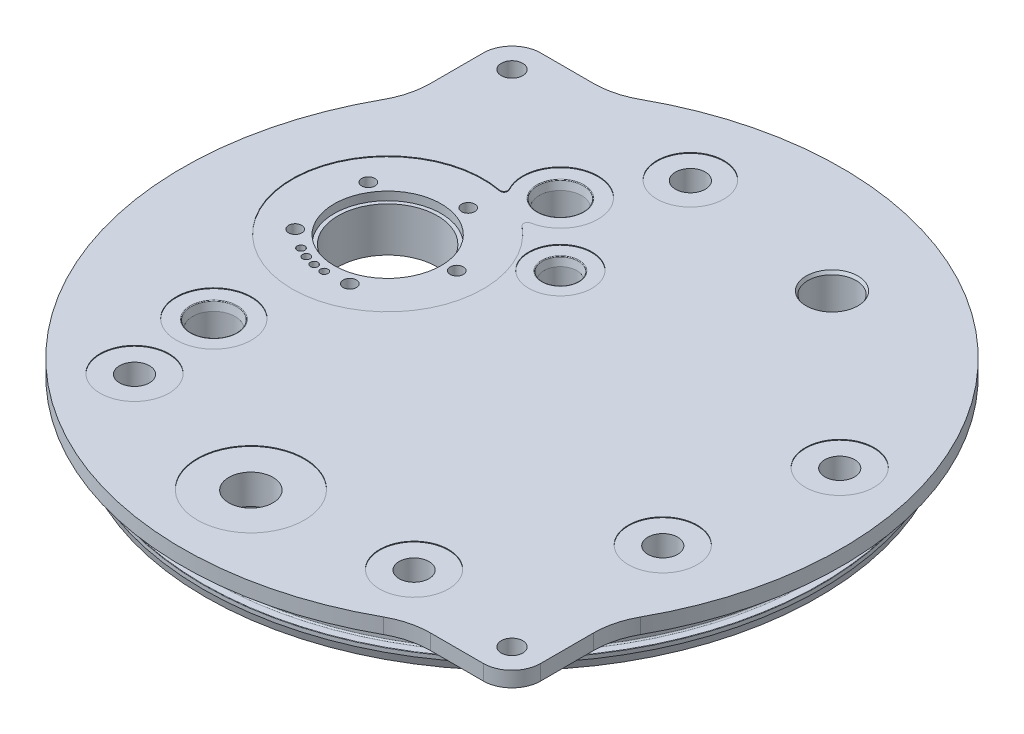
from build123d import *

# Parameters (mm, degrees)
SKETCH240_R                                      = 174.564205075
SKETCH240_R_2                                    = 109.5375
CUT_EXTRUDE2_DEPTH                               = 173.352640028
BOSS_EXTRUDE2_DEPTH                              = 5.08
F_9_32_0_28125_DIAMETER_HOLE1_D                  = 7.14375
CTD_PORT_D                                       = 33.02
CTD_PORT_CBORE_D                                 = 35.56
CTD_PORT_CBORE_DEPTH                             = 3.048
SKETCH237_R                                      = 31.75
CUT_EXTRUDE1_DEPTH                               = 0.254
F_38_0_1015_DIAMETER_HOLE1_D                     = 2.54
F_17_0_173_DIAMETER_HOLE1_D                      = 4.3942
FILLET1_R                                        = 1.27
F_4_40_TAPPED_HOLE2_D                            = 2.2606
F_4_40_TAPPED_HOLE2_DEPTH                        = 8.382
F_4_40_TAPPED_HOLE2_TIP                          = 0.679152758
THREAD_FOR_ANTENNA_PORT_D                        = 14.68374
ANTENNA_PORT_D                                   = 6.7564
ANTENNA_PORT_CBORE_D                             = 35.56
ANTENNA_PORT_CBORE_DEPTH                         = 0.254
CBORE_FOR_1_4_SOCKET_HEAD_CAP_SCREW2_D           = 6.7564
CBORE_FOR_1_4_SOCKET_HEAD_CAP_SCREW2_CBORE_D     = 28.575
CBORE_FOR_1_4_SOCKET_HEAD_CAP_SCREW2_CBORE_DEPTH = 7.62
SUBCONN_PORTS_D                                  = 2.54
SUBCONN_PORTS_DEPTH                              = 25.4
SUBCONN_PORTS_CBORE_D                            = 22.86
SUBCONN_PORTS_CBORE_DEPTH                        = 0.254
F_7_16_20_TAPPED_HOLE1_D                         = 9.92124
F_7_16_20_TAPPED_HOLE3_D                         = 9.92124
CBORE_FOR_7_16_HEX_HEAD_BOLT1_D                  = 9.92124
CBORE_FOR_7_16_HEX_HEAD_BOLT1_CBORE_D            = 22.2504
CBORE_FOR_7_16_HEX_HEAD_BOLT1_CBORE_DEPTH        = 0.254


with BuildPart() as part:
    # Sketch1 → Revolve1 (revolve)
    with BuildSketch(Plane.XY, mode=Mode.PRIVATE) as revolve1_sk:
        Polygon((0, 5.08), (-121.2215, 5.08), (-121.2215, 0), (-102.5779, 0), (-102.5779, -10.16), (-101.897309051, -12.7), (0, -12.7), align=None)
    revolve(revolve1_sk.sketch.rotate(Axis((0, -18.420388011, 0), (0, 1, 0)), 270), axis=Axis((0, -18.420388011, 0), (0, 1, 0)))

    # Sketch240 → Cut-Extrude2 (cut, through all)
    with BuildSketch(Plane(origin=(0, 5.08, 0), x_dir=(1, 0, 0), z_dir=(0, 1, 0))):
        Circle(SKETCH240_R)
        with Locations(Location((0, 0, 0), (0, 0, 270))):
            Circle(SKETCH240_R_2, mode=Mode.SUBTRACT)
    extrude(amount=-CUT_EXTRUDE2_DEPTH, mode=Mode.SUBTRACT)

    # Sketch242 → Boss-Extrude2 (add)
    with BuildSketch(Plane(origin=(0, 5.08, 0), x_dir=(1, 0, 0), z_dir=(0, 1, 0))):
        with BuildLine():
            Line((-92.59236912, 83.06736912), (-92.59236912, 65.467012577))
            ThreePointArc((-92.59236912, 65.467012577), (-93.402713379, 59.102357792), (-95.782040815, 53.143810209))
            ThreePointArc((-95.782040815, 53.143810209), (-77.454709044, 77.454709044), (-53.143810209, 95.782040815))
            ThreePointArc((-53.143810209, 95.782040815), (-59.102357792, 93.402713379), (-65.467012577, 92.59236912))
            Line((-65.467012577, 92.59236912), (-83.06736912, 92.59236912))
            ThreePointArc((-83.06736912, 92.59236912), (-89.802561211, 89.802561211), (-92.59236912, 83.06736912))
        make_face()
        with BuildLine():
            Line((92.59236912, -83.06736912), (92.59236912, -65.467012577))
            ThreePointArc((92.59236912, -65.467012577), (93.402713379, -59.102357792), (95.782040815, -53.143810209))
            ThreePointArc((95.782040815, -53.143810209), (77.454709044, -77.454709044), (53.143810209, -95.782040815))
            ThreePointArc((53.143810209, -95.782040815), (59.102357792, -93.402713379), (65.467012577, -92.59236912))
            Line((65.467012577, -92.59236912), (83.06736912, -92.59236912))
            ThreePointArc((83.06736912, -92.59236912), (89.802561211, -89.802561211), (92.59236912, -83.06736912))
        make_face()
    extrude(amount=-BOSS_EXTRUDE2_DEPTH)

    # 9_32 _0.28125_ Diameter Hole1 (through all)
    with Locations(Plane(origin=(0, 5.08, 0), x_dir=(1, 0, 0), z_dir=(0, 1, 0))):
        with Locations((0, 114.2365), (-83.06736912, 83.06736912), (-114.2365, 0), (-80.777403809, -80.777403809), (0, -114.2365), (83.06736912, -83.06736912), (114.2365, 0), (80.777403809, 80.777403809)):
            Hole(F_9_32_0_28125_DIAMETER_HOLE1_D / 2)

    # Sketch234 → 2-265 O-Ring (revolve, cut)
    with BuildSketch(Plane.XY, mode=Mode.PRIVATE) as f_2_265_o_ring_sk:
        with BuildLine():
            Line((-102.4509, -3.94335), (-100.1776, -3.94335))
            ThreePointArc((-100.1776, -3.94335), (-99.863291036, -4.073541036), (-99.7331, -4.38785))
            Line((-99.7331, -4.38785), (-99.7331, -8.31215))
            ThreePointArc((-99.7331, -8.31215), (-99.863291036, -8.626458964), (-100.1776, -8.75665))
            Line((-100.1776, -8.75665), (-102.4509, -8.75665))
            ThreePointArc((-102.4509, -8.75665), (-102.540702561, -8.793847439), (-102.5779, -8.88365))
            Line((-102.5779, -8.88365), (-102.5779, -3.81635))
            ThreePointArc((-102.5779, -3.81635), (-102.540702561, -3.906152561), (-102.4509, -3.94335))
        make_face()
    revolve(f_2_265_o_ring_sk.sketch.rotate(Axis((0, 0, 0), (0, -1, 0)), 270), axis=Axis((0, 0, 0), (0, -1, 0)), mode=Mode.SUBTRACT)

    # CTD Port (through all)
    with Locations(Plane(origin=(0, 5.08, 0), x_dir=(1, 0, 0), z_dir=(0, 1, 0))):
        with Locations((-56.429386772, 15.120208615)):
            CounterBoreHole(CTD_PORT_D / 2, CTD_PORT_CBORE_D / 2, CTD_PORT_CBORE_DEPTH)

    # Sketch237 → Cut-Extrude1 (cut)
    with BuildSketch(Plane(origin=(0, 5.08, 0), x_dir=(1, 0, 0), z_dir=(0, 1, 0))):
        with Locations(Location((-56.429386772, 15.120208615, 0), (0, 0, 270))):
            Circle(SKETCH237_R)
    extrude(amount=-CUT_EXTRUDE1_DEPTH, mode=Mode.SUBTRACT)

    # 38 _0.1015_ Diameter Hole1 (through all)
    with Locations(Plane(origin=(0, 5.08, 0), x_dir=(1, 0, 0), z_dir=(0, 1, 0))):
        with Locations((-66.970386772, -3.137338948), (-63.639855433, -4.690391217), (-60.090237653, -5.641508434), (-56.429386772, -5.961791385)):
            Hole(F_38_0_1015_DIAMETER_HOLE1_D / 2)

    # 17 _0.173_ Diameter Hole1 (through all)
    with Locations(Plane(origin=(0, 5.08, 0), x_dir=(1, 0, 0), z_dir=(0, 1, 0))):
        with Locations((-50.775743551, 36.219892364), (-74.749306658, 27.017303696), (-73.405363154, 1.373333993), (-48.601197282, -5.272922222), (-34.615323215, 16.263435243)):
            Hole(F_17_0_173_DIAMETER_HOLE1_D / 2)

    # Port Sketch1 → SAE Port1 (revolve, cut)
    with BuildSketch(Plane(origin=(-35.123411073, 5.08, -54.254578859), x_dir=(-1, 0, 0), z_dir=(0, 0, 1)), mode=Mode.PRIVATE) as sae_port1_sk:
        with BuildLine():
            Line((3.057319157, 54.988507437), (9.605439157, 51.054))
            Line((9.605439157, 51.054), (9.605439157, 12.954))
            Line((9.605439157, 12.954), (10.201069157, 12.954))
            Line((10.201069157, 12.954), (10.201069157, 2.880662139))
            Line((10.201069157, 2.880662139), (10.127731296, 2.954))
            Line((10.127731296, 2.954), (10.658869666, 0.455190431))
            ThreePointArc((10.658869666, 0.455190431), (10.747471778, 0.310604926), (10.907319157, 0.254))
            Line((10.907319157, 0.254), (15.557319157, 0.254))
            Line((15.557319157, 0.254), (15.557319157, 0))
            Line((15.557319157, 0), (3.057319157, 0))
            Line((3.057319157, 0), (3.057319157, 54.988507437))
        make_face()
    revolve(sae_port1_sk.sketch.rotate(Axis((-38.18073023, 5.08, -54.254578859), (0, -1, 0)), 270), axis=Axis((-38.18073023, 5.08, -54.254578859), (0, -1, 0)), mode=Mode.SUBTRACT)

    # Port Sketch2 → SAE Port2 (revolve, cut)
    with BuildSketch(Plane(origin=(-14.237697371, 5.08, -33.368865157), x_dir=(-1, 0, 0), z_dir=(0, 0, 1)), mode=Mode.PRIVATE) as sae_port2_sk:
        with BuildLine():
            Line((3.057319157, 54.034641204), (8.017939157, 51.054))
            Line((8.017939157, 51.054), (8.017939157, 11.754))
            Line((8.017939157, 11.754), (8.613569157, 11.754))
            Line((8.613569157, 11.754), (8.613569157, 2.764417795))
            Line((8.613569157, 2.764417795), (8.523986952, 2.854))
            Line((8.523986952, 2.854), (9.033869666, 0.455190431))
            ThreePointArc((9.033869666, 0.455190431), (9.122471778, 0.310604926), (9.282319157, 0.254))
            Line((9.282319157, 0.254), (13.557319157, 0.254))
            Line((13.557319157, 0.254), (13.557319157, 0))
            Line((13.557319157, 0), (3.057319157, 0))
            Line((3.057319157, 0), (3.057319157, 54.034641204))
        make_face()
    revolve(sae_port2_sk.sketch.rotate(Axis((-17.295016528, 5.08, -33.368865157), (0, -1, 0)), 270), axis=Axis((-17.295016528, 5.08, -33.368865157), (0, -1, 0)), mode=Mode.SUBTRACT)

    # Port Sketch → SAE Port (revolve, cut)
    with BuildSketch(Plane(origin=(-59.86751663, 5.08, 38.690676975), x_dir=(-0.8796575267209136, 0, -0.47560764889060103), z_dir=(-0.47560764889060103, 0, 0.8796575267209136)), mode=Mode.PRIVATE) as sae_port_sk:
        with BuildLine():
            Line((1.241941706, 19.688507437), (7.790061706, 15.754))
            Line((7.790061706, 15.754), (7.790061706, 12.954))
            Line((7.790061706, 12.954), (8.385691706, 12.954))
            Line((8.385691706, 12.954), (8.385691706, 2.880662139))
            Line((8.385691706, 2.880662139), (8.312353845, 2.954))
            Line((8.312353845, 2.954), (8.843492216, 0.455190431))
            ThreePointArc((8.843492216, 0.455190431), (8.932094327, 0.310604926), (9.091941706, 0.254))
            Line((9.091941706, 0.254), (13.741941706, 0.254))
            Line((13.741941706, 0.254), (13.741941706, 0))
            Line((13.741941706, 0), (1.241941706, 0))
            Line((1.241941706, 0), (1.241941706, 19.688507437))
        make_face()
    revolve(sae_port_sk.sketch.rotate(Axis((-60.96, 5.08, 38.1), (0, -1, 0)), 241.601078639), axis=Axis((-60.96, 5.08, 38.1), (0, -1, 0)), mode=Mode.SUBTRACT)

    # Fillet1
    fillet1_edges = [part.edges().sort_by_distance(p)[0] for p in [
        (-39.213244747, 4.953, -41.797295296),
        (-47.059875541, 4.953, -45.456239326),
    ]]
    fillet(fillet1_edges, radius=FILLET1_R)

    # Sketch41 → Optode Port (revolve, cut)
    with BuildSketch(Plane(origin=(33.813687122, -12.7, -72.513686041), x_dir=(0, 0, -1), z_dir=(1, 0, 0))):
        Polygon((0, 0), (0, 17.78), (8.606588, 17.78), (8.02, 16.763999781), (8.02, 5.08), (15.875, 5.08), (15.875, 0), align=None)
    revolve(axis=Axis((33.813687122, -19.05, -72.513686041), (0, 1, 0)), mode=Mode.SUBTRACT)

    # 4-40 Tapped Hole2
    with Locations(Plane(origin=(0, -12.7, 0), x_dir=(-1, 0, 0), z_dir=(0, -1, 0))):
        with Locations((-8.413687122, 72.513686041), (-59.213687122, 72.513686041)):
            Hole(F_4_40_TAPPED_HOLE2_D / 2, depth=F_4_40_TAPPED_HOLE2_DEPTH)
            with Locations((0, 0, -(F_4_40_TAPPED_HOLE2_DEPTH + F_4_40_TAPPED_HOLE2_TIP / 2))):  # 118° drill point
                Cone(0, F_4_40_TAPPED_HOLE2_D / 2, F_4_40_TAPPED_HOLE2_TIP, mode=Mode.SUBTRACT)

    # Thread For Antenna Port (through all)
    with Locations(Plane(origin=(0, 5.08, 0), x_dir=(1, 0, 0), z_dir=(0, 1, 0))):
        with Locations((-5.669806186, -81.082006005)):
            Hole(THREAD_FOR_ANTENNA_PORT_D / 2)

    # Antenna Port (through all)
    with Locations(Plane(origin=(0, 5.08, 0), x_dir=(1, 0, 0), z_dir=(0, 1, 0))):
        with Locations((-5.669806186, -81.082006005)):
            CounterBoreHole(ANTENNA_PORT_D / 2, ANTENNA_PORT_CBORE_D / 2, ANTENNA_PORT_CBORE_DEPTH)

    # CBORE for 1_4 Socket Head Cap Screw2 (through all)
    with Locations(Plane(origin=(0, -12.7, 0), x_dir=(-1, 0, 0), z_dir=(0, -1, 0))):
        with Locations((5.669806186, -81.082006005)):
            CounterBoreHole(CBORE_FOR_1_4_SOCKET_HEAD_CAP_SCREW2_D / 2, CBORE_FOR_1_4_SOCKET_HEAD_CAP_SCREW2_CBORE_D / 2, CBORE_FOR_1_4_SOCKET_HEAD_CAP_SCREW2_CBORE_DEPTH)

    # Subconn Ports
    with Locations(Plane(origin=(0, 5.08, 0), x_dir=(1, 0, 0), z_dir=(0, 1, 0))):
        with Locations((85.870805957, 23.00901311), (-58.323647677, -67.093681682), (44.45, -76.989658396), (78.765035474, -28.668128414)):
            CounterBoreHole(SUBCONN_PORTS_D / 2, SUBCONN_PORTS_CBORE_D / 2, SUBCONN_PORTS_CBORE_DEPTH, depth=SUBCONN_PORTS_DEPTH)

    # 7_16-20 Tapped Hole1 (through all)
    with Locations(Plane(origin=(0, 5.08, 0), x_dir=(1, 0, 0), z_dir=(0, 1, 0))):
        with Locations((-58.323647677, -67.093681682), (44.45, -76.989658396), (78.765035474, -28.668128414), (85.870805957, 23.00901311)):
            Hole(F_7_16_20_TAPPED_HOLE1_D / 2)

    # 7_16-20 Tapped Hole3 (through all)
    with Locations(Plane(origin=(0, 5.08, 0), x_dir=(1, 0, 0), z_dir=(0, 1, 0))):
        with Locations((-21.69421236, 80.96390276)):
            Hole(F_7_16_20_TAPPED_HOLE3_D / 2)

    # CBORE for 7_16 Hex Head Bolt1 (through all)
    with Locations(Plane(origin=(0, 5.08, 0), x_dir=(1, 0, 0), z_dir=(0, 1, 0))):
        with Locations((-21.69421236, 80.96390276)):
            CounterBoreHole(CBORE_FOR_7_16_HEX_HEAD_BOLT1_D / 2, CBORE_FOR_7_16_HEX_HEAD_BOLT1_CBORE_D / 2, CBORE_FOR_7_16_HEX_HEAD_BOLT1_CBORE_DEPTH)


solid = part.part
